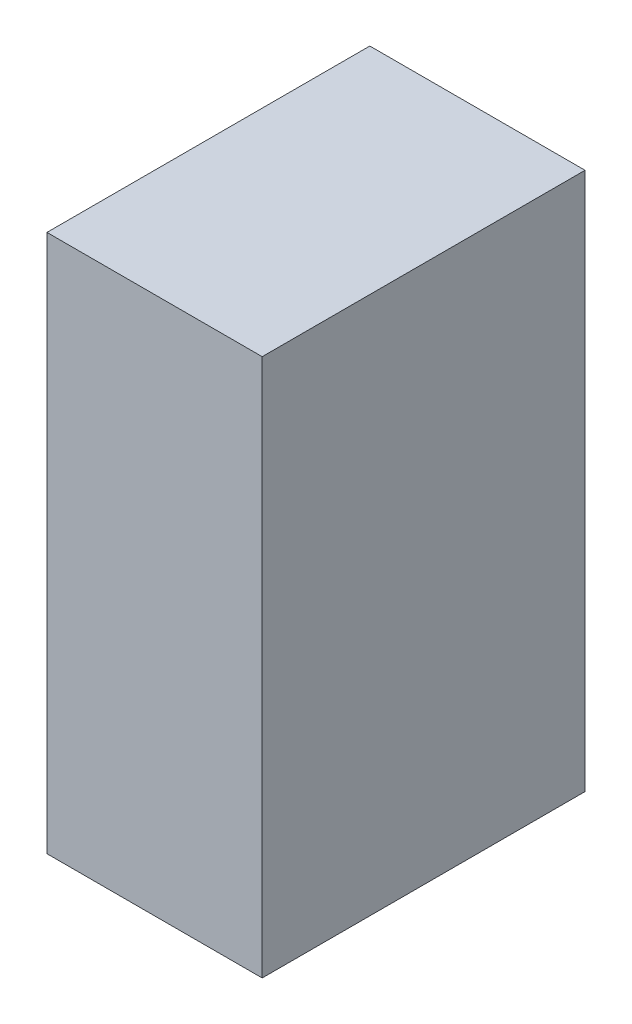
ISO-10303-21;
HEADER;
FILE_DESCRIPTION(('STEP AP214'),'2;1');
FILE_NAME('part.step','',(''),(''),'','','');
FILE_SCHEMA(('AUTOMOTIVE_DESIGN { 1 0 10303 214 1 1 1 1 }'));
ENDSEC;
DATA;
#1=APPLICATION_CONTEXT('core data for automotive mechanical design processes');
#2=APPLICATION_PROTOCOL_DEFINITION('international standard','automotive_design',2000,#1);
#3=PRODUCT_CONTEXT('',#1,'mechanical');
#4=PRODUCT('Part','Part','',(#3));
#5=PRODUCT_RELATED_PRODUCT_CATEGORY('part','',(#4));
#6=PRODUCT_DEFINITION_FORMATION('','',#4);
#7=PRODUCT_DEFINITION_CONTEXT('part definition',#1,'design');
#8=PRODUCT_DEFINITION('design','',#6,#7);
#9=PRODUCT_DEFINITION_SHAPE('','',#8);
#10=(LENGTH_UNIT() NAMED_UNIT(*) SI_UNIT(.MILLI.,.METRE.));
#11=(NAMED_UNIT(*) PLANE_ANGLE_UNIT() SI_UNIT($,.RADIAN.));
#12=(NAMED_UNIT(*) SI_UNIT($,.STERADIAN.) SOLID_ANGLE_UNIT());
#13=UNCERTAINTY_MEASURE_WITH_UNIT(LENGTH_MEASURE(1.E-05),#10,'distance_accuracy_value','');
#14=(GEOMETRIC_REPRESENTATION_CONTEXT(3) GLOBAL_UNCERTAINTY_ASSIGNED_CONTEXT((#13)) GLOBAL_UNIT_ASSIGNED_CONTEXT((#10,
#11,#12)) REPRESENTATION_CONTEXT('',''));
#15=CARTESIAN_POINT('',(0.,0.,0.));
#16=DIRECTION('',(0.,0.,1.));
#17=DIRECTION('',(1.,0.,0.));
#18=AXIS2_PLACEMENT_3D('',#15,#16,#17);
#19=CARTESIAN_POINT('',(-0.254,0.635,0.));
#20=DIRECTION('',(1.,0.,0.));
#21=DIRECTION('',(0.,0.,-1.));
#22=AXIS2_PLACEMENT_3D('',#19,#20,#21);
#23=PLANE('',#22);
#24=DIRECTION('',(0.,0.,1.));
#25=VECTOR('',#24,1.);
#26=CARTESIAN_POINT('',(-0.254,-0.635,0.));
#27=LINE('',#26,#25);
#28=CARTESIAN_POINT('',(-0.254,-0.635,0.));
#29=VERTEX_POINT('',#28);
#30=CARTESIAN_POINT('',(-0.254,-0.635,0.762));
#31=VERTEX_POINT('',#30);
#32=EDGE_CURVE('E20',#29,#31,#27,.T.);
#33=ORIENTED_EDGE('',*,*,#32,.T.);
#34=DIRECTION('',(0.,1.,0.));
#35=VECTOR('',#34,1.);
#36=CARTESIAN_POINT('',(-0.254,-0.635,0.762));
#37=LINE('',#36,#35);
#38=CARTESIAN_POINT('',(-0.254,0.635,0.762));
#39=VERTEX_POINT('',#38);
#40=EDGE_CURVE('E55',#31,#39,#37,.T.);
#41=ORIENTED_EDGE('',*,*,#40,.T.);
#42=DIRECTION('',(0.,0.,-1.));
#43=VECTOR('',#42,1.);
#44=CARTESIAN_POINT('',(-0.254,0.635,0.));
#45=LINE('',#44,#43);
#46=CARTESIAN_POINT('',(-0.254,0.635,0.));
#47=VERTEX_POINT('',#46);
#48=EDGE_CURVE('E74',#39,#47,#45,.T.);
#49=ORIENTED_EDGE('',*,*,#48,.T.);
#50=DIRECTION('',(0.,1.,0.));
#51=VECTOR('',#50,1.);
#52=CARTESIAN_POINT('',(-0.254,-0.635,0.));
#53=LINE('',#52,#51);
#54=EDGE_CURVE('E66',#29,#47,#53,.T.);
#55=ORIENTED_EDGE('',*,*,#54,.F.);
#56=EDGE_LOOP('',(#33,#41,#49,#55));
#57=FACE_BOUND('',#56,.T.);
#58=ADVANCED_FACE('F17',(#57),#23,.F.);
#59=CARTESIAN_POINT('',(-0.254,-0.635,0.));
#60=DIRECTION('',(0.,1.,0.));
#61=DIRECTION('',(0.,0.,1.));
#62=AXIS2_PLACEMENT_3D('',#59,#60,#61);
#63=PLANE('',#62);
#64=DIRECTION('',(0.,0.,1.));
#65=VECTOR('',#64,1.);
#66=CARTESIAN_POINT('',(0.254,-0.635,0.));
#67=LINE('',#66,#65);
#68=CARTESIAN_POINT('',(0.254,-0.635,0.));
#69=VERTEX_POINT('',#68);
#70=CARTESIAN_POINT('',(0.254,-0.635,0.762));
#71=VERTEX_POINT('',#70);
#72=EDGE_CURVE('E72',#69,#71,#67,.T.);
#73=ORIENTED_EDGE('',*,*,#72,.T.);
#74=DIRECTION('',(-1.,0.,0.));
#75=VECTOR('',#74,1.);
#76=CARTESIAN_POINT('',(-0.254,-0.635,0.762));
#77=LINE('',#76,#75);
#78=EDGE_CURVE('E62',#71,#31,#77,.T.);
#79=ORIENTED_EDGE('',*,*,#78,.T.);
#80=ORIENTED_EDGE('',*,*,#32,.F.);
#81=DIRECTION('',(-1.,0.,0.));
#82=VECTOR('',#81,1.);
#83=CARTESIAN_POINT('',(-0.254,-0.635,0.));
#84=LINE('',#83,#82);
#85=EDGE_CURVE('E80',#69,#29,#84,.T.);
#86=ORIENTED_EDGE('',*,*,#85,.F.);
#87=EDGE_LOOP('',(#73,#79,#80,#86));
#88=FACE_BOUND('',#87,.T.);
#89=ADVANCED_FACE('F71',(#88),#63,.F.);
#90=CARTESIAN_POINT('',(-0.254,-0.635,0.762));
#91=DIRECTION('',(0.,0.,-1.));
#92=DIRECTION('',(-1.,0.,0.));
#93=AXIS2_PLACEMENT_3D('',#90,#91,#92);
#94=PLANE('',#93);
#95=DIRECTION('',(0.,1.,0.));
#96=VECTOR('',#95,1.);
#97=CARTESIAN_POINT('',(0.254,-0.635,0.762));
#98=LINE('',#97,#96);
#99=CARTESIAN_POINT('',(0.254,0.635,0.762));
#100=VERTEX_POINT('',#99);
#101=EDGE_CURVE('E83',#71,#100,#98,.T.);
#102=ORIENTED_EDGE('',*,*,#101,.T.);
#103=DIRECTION('',(1.,0.,0.));
#104=VECTOR('',#103,1.);
#105=CARTESIAN_POINT('',(0.254,0.635,0.762));
#106=LINE('',#105,#104);
#107=EDGE_CURVE('E64',#100,#39,#106,.F.);
#108=ORIENTED_EDGE('',*,*,#107,.T.);
#109=ORIENTED_EDGE('',*,*,#40,.F.);
#110=ORIENTED_EDGE('',*,*,#78,.F.);
#111=EDGE_LOOP('',(#102,#108,#109,#110));
#112=FACE_BOUND('',#111,.T.);
#113=ADVANCED_FACE('F60',(#112),#94,.F.);
#114=CARTESIAN_POINT('',(0.254,0.635,0.));
#115=DIRECTION('',(0.,-1.,0.));
#116=DIRECTION('',(0.,0.,-1.));
#117=AXIS2_PLACEMENT_3D('',#114,#115,#116);
#118=PLANE('',#117);
#119=ORIENTED_EDGE('',*,*,#48,.F.);
#120=ORIENTED_EDGE('',*,*,#107,.F.);
#121=DIRECTION('',(0.,0.,1.));
#122=VECTOR('',#121,1.);
#123=CARTESIAN_POINT('',(0.254,0.635,0.));
#124=LINE('',#123,#122);
#125=CARTESIAN_POINT('',(0.254,0.635,0.));
#126=VERTEX_POINT('',#125);
#127=EDGE_CURVE('E26',#100,#126,#124,.F.);
#128=ORIENTED_EDGE('',*,*,#127,.T.);
#129=DIRECTION('',(-1.,0.,0.));
#130=VECTOR('',#129,1.);
#131=CARTESIAN_POINT('',(-0.254,0.635,0.));
#132=LINE('',#131,#130);
#133=EDGE_CURVE('E34',#47,#126,#132,.F.);
#134=ORIENTED_EDGE('',*,*,#133,.F.);
#135=EDGE_LOOP('',(#119,#120,#128,#134));
#136=FACE_BOUND('',#135,.T.);
#137=ADVANCED_FACE('F88',(#136),#118,.F.);
#138=CARTESIAN_POINT('',(-0.254,-0.635,0.));
#139=DIRECTION('',(0.,0.,-1.));
#140=DIRECTION('',(-1.,0.,0.));
#141=AXIS2_PLACEMENT_3D('',#138,#139,#140);
#142=PLANE('',#141);
#143=DIRECTION('',(0.,1.,0.));
#144=VECTOR('',#143,1.);
#145=CARTESIAN_POINT('',(0.254,-0.635,0.));
#146=LINE('',#145,#144);
#147=EDGE_CURVE('E11',#126,#69,#146,.F.);
#148=ORIENTED_EDGE('',*,*,#147,.T.);
#149=ORIENTED_EDGE('',*,*,#85,.T.);
#150=ORIENTED_EDGE('',*,*,#54,.T.);
#151=ORIENTED_EDGE('',*,*,#133,.T.);
#152=EDGE_LOOP('',(#148,#149,#150,#151));
#153=FACE_BOUND('',#152,.T.);
#154=ADVANCED_FACE('F91',(#153),#142,.T.);
#155=CARTESIAN_POINT('',(0.254,-0.635,0.));
#156=DIRECTION('',(-1.,0.,0.));
#157=DIRECTION('',(0.,0.,1.));
#158=AXIS2_PLACEMENT_3D('',#155,#156,#157);
#159=PLANE('',#158);
#160=ORIENTED_EDGE('',*,*,#127,.F.);
#161=ORIENTED_EDGE('',*,*,#101,.F.);
#162=ORIENTED_EDGE('',*,*,#72,.F.);
#163=ORIENTED_EDGE('',*,*,#147,.F.);
#164=EDGE_LOOP('',(#160,#161,#162,#163));
#165=FACE_BOUND('',#164,.T.);
#166=ADVANCED_FACE('F90',(#165),#159,.F.);
#167=CLOSED_SHELL('',(#58,#89,#113,#137,#154,#166));
#168=MANIFOLD_SOLID_BREP('B1',#167);
#169=ADVANCED_BREP_SHAPE_REPRESENTATION('',(#18,#168),#14);
#170=SHAPE_DEFINITION_REPRESENTATION(#9,#169);
ENDSEC;
END-ISO-10303-21;
